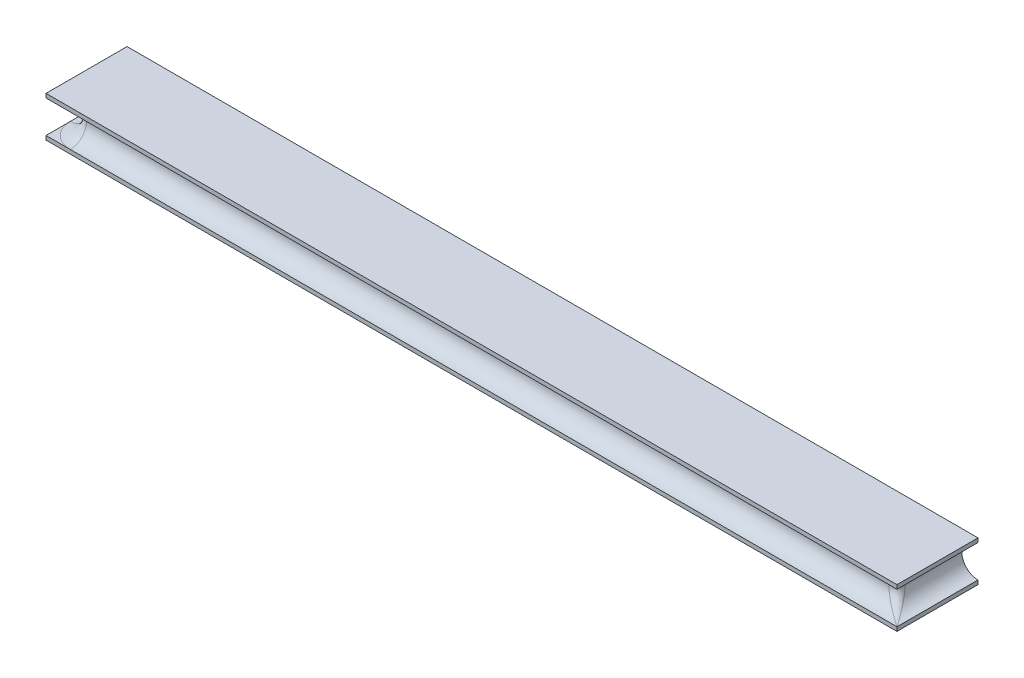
ISO-10303-21;
HEADER;
FILE_DESCRIPTION(('STEP AP214'),'2;1');
FILE_NAME('part.step','',(''),(''),'','','');
FILE_SCHEMA(('AUTOMOTIVE_DESIGN { 1 0 10303 214 1 1 1 1 }'));
ENDSEC;
DATA;
#1=APPLICATION_CONTEXT('core data for automotive mechanical design processes');
#2=APPLICATION_PROTOCOL_DEFINITION('international standard','automotive_design',2000,#1);
#3=PRODUCT_CONTEXT('',#1,'mechanical');
#4=PRODUCT('Part','Part','',(#3));
#5=PRODUCT_RELATED_PRODUCT_CATEGORY('part','',(#4));
#6=PRODUCT_DEFINITION_FORMATION('','',#4);
#7=PRODUCT_DEFINITION_CONTEXT('part definition',#1,'design');
#8=PRODUCT_DEFINITION('design','',#6,#7);
#9=PRODUCT_DEFINITION_SHAPE('','',#8);
#10=(LENGTH_UNIT() NAMED_UNIT(*) SI_UNIT(.MILLI.,.METRE.));
#11=(NAMED_UNIT(*) PLANE_ANGLE_UNIT() SI_UNIT($,.RADIAN.));
#12=(NAMED_UNIT(*) SI_UNIT($,.STERADIAN.) SOLID_ANGLE_UNIT());
#13=UNCERTAINTY_MEASURE_WITH_UNIT(LENGTH_MEASURE(1.E-05),#10,'distance_accuracy_value','');
#14=(GEOMETRIC_REPRESENTATION_CONTEXT(3) GLOBAL_UNCERTAINTY_ASSIGNED_CONTEXT((#13)) GLOBAL_UNIT_ASSIGNED_CONTEXT((#10,
#11,#12)) REPRESENTATION_CONTEXT('',''));
#15=CARTESIAN_POINT('',(0.,0.,0.));
#16=DIRECTION('',(0.,0.,1.));
#17=DIRECTION('',(1.,0.,0.));
#18=AXIS2_PLACEMENT_3D('',#15,#16,#17);
#19=CARTESIAN_POINT('',(52.5,2.5,-5.));
#20=DIRECTION('',(-1.,0.,0.));
#21=DIRECTION('',(0.,0.,1.));
#22=AXIS2_PLACEMENT_3D('',#19,#20,#21);
#23=PLANE('',#22);
#24=DIRECTION('',(0.,-1.,0.));
#25=VECTOR('',#24,1.);
#26=CARTESIAN_POINT('',(52.5,2.5,5.));
#27=LINE('',#26,#25);
#28=CARTESIAN_POINT('',(52.5,2.5,5.));
#29=VERTEX_POINT('',#28);
#30=CARTESIAN_POINT('',(52.5,2.,5.00000000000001));
#31=VERTEX_POINT('',#30);
#32=EDGE_CURVE('E146',#29,#31,#27,.T.);
#33=ORIENTED_EDGE('',*,*,#32,.T.);
#34=DIRECTION('',(0.,0.,-1.));
#35=VECTOR('',#34,1.);
#36=CARTESIAN_POINT('',(52.5,2.,5.00000000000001));
#37=LINE('',#36,#35);
#38=CARTESIAN_POINT('',(52.5,2.,-5.));
#39=VERTEX_POINT('',#38);
#40=EDGE_CURVE('E113',#31,#39,#37,.T.);
#41=ORIENTED_EDGE('',*,*,#40,.T.);
#42=DIRECTION('',(0.,-1.,0.));
#43=VECTOR('',#42,1.);
#44=CARTESIAN_POINT('',(52.5,2.5,-5.));
#45=LINE('',#44,#43);
#46=CARTESIAN_POINT('',(52.5,2.5,-5.));
#47=VERTEX_POINT('',#46);
#48=EDGE_CURVE('E147',#47,#39,#45,.T.);
#49=ORIENTED_EDGE('',*,*,#48,.F.);
#50=DIRECTION('',(0.,0.,-1.));
#51=VECTOR('',#50,1.);
#52=CARTESIAN_POINT('',(52.5,2.5,-5.));
#53=LINE('',#52,#51);
#54=EDGE_CURVE('E163',#29,#47,#53,.T.);
#55=ORIENTED_EDGE('',*,*,#54,.F.);
#56=EDGE_LOOP('',(#33,#41,#49,#55));
#57=FACE_BOUND('',#56,.T.);
#58=ADVANCED_FACE('F31',(#57),#23,.F.);
#59=CARTESIAN_POINT('',(-52.5,2.5,-5.));
#60=DIRECTION('',(1.,0.,0.));
#61=DIRECTION('',(0.,0.,-1.));
#62=AXIS2_PLACEMENT_3D('',#59,#60,#61);
#63=PLANE('',#62);
#64=DIRECTION('',(0.,0.,-1.));
#65=VECTOR('',#64,1.);
#66=CARTESIAN_POINT('',(-52.5,2.,-5.));
#67=LINE('',#66,#65);
#68=CARTESIAN_POINT('',(-52.5,2.,5.));
#69=VERTEX_POINT('',#68);
#70=CARTESIAN_POINT('',(-52.5,2.,2.));
#71=VERTEX_POINT('',#70);
#72=EDGE_CURVE('E178',#69,#71,#67,.T.);
#73=ORIENTED_EDGE('',*,*,#72,.F.);
#74=DIRECTION('',(0.,-1.,0.));
#75=VECTOR('',#74,1.);
#76=CARTESIAN_POINT('',(-52.5,2.5,5.));
#77=LINE('',#76,#75);
#78=CARTESIAN_POINT('',(-52.5,2.5,5.));
#79=VERTEX_POINT('',#78);
#80=EDGE_CURVE('E150',#79,#69,#77,.T.);
#81=ORIENTED_EDGE('',*,*,#80,.F.);
#82=DIRECTION('',(0.,0.,1.));
#83=VECTOR('',#82,1.);
#84=CARTESIAN_POINT('',(-52.5,2.5,-5.));
#85=LINE('',#84,#83);
#86=CARTESIAN_POINT('',(-52.5,2.5,-5.));
#87=VERTEX_POINT('',#86);
#88=EDGE_CURVE('E167',#87,#79,#85,.T.);
#89=ORIENTED_EDGE('',*,*,#88,.F.);
#90=DIRECTION('',(0.,-1.,0.));
#91=VECTOR('',#90,1.);
#92=CARTESIAN_POINT('',(-52.5,2.5,-5.));
#93=LINE('',#92,#91);
#94=CARTESIAN_POINT('',(-52.5,2.00000000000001,-5.));
#95=VERTEX_POINT('',#94);
#96=EDGE_CURVE('E158',#87,#95,#93,.T.);
#97=ORIENTED_EDGE('',*,*,#96,.T.);
#98=DIRECTION('',(0.,0.,-1.));
#99=VECTOR('',#98,1.);
#100=CARTESIAN_POINT('',(-52.5,2.,2.));
#101=LINE('',#100,#99);
#102=EDGE_CURVE('E46',#71,#95,#101,.T.);
#103=ORIENTED_EDGE('',*,*,#102,.F.);
#104=EDGE_LOOP('',(#73,#81,#89,#97,#103));
#105=FACE_BOUND('',#104,.T.);
#106=ADVANCED_FACE('F33',(#105),#63,.F.);
#107=DIRECTION('',(0.,0.,-1.));
#108=VECTOR('',#107,1.);
#109=CARTESIAN_POINT('',(-52.5,-2.,2.));
#110=LINE('',#109,#108);
#111=CARTESIAN_POINT('',(-52.5,-2.,2.));
#112=VERTEX_POINT('',#111);
#113=CARTESIAN_POINT('',(-52.5,-2.,-5.));
#114=VERTEX_POINT('',#113);
#115=EDGE_CURVE('E193',#112,#114,#110,.T.);
#116=ORIENTED_EDGE('',*,*,#115,.T.);
#117=CARTESIAN_POINT('',(-52.5,-2.5,-5.));
#118=VERTEX_POINT('',#117);
#119=EDGE_CURVE('E161',#114,#118,#93,.T.);
#120=ORIENTED_EDGE('',*,*,#119,.T.);
#121=DIRECTION('',(0.,0.,1.));
#122=VECTOR('',#121,1.);
#123=CARTESIAN_POINT('',(-52.5,-2.5,-5.));
#124=LINE('',#123,#122);
#125=CARTESIAN_POINT('',(-52.5,-2.5,5.));
#126=VERTEX_POINT('',#125);
#127=EDGE_CURVE('E175',#118,#126,#124,.T.);
#128=ORIENTED_EDGE('',*,*,#127,.T.);
#129=CARTESIAN_POINT('',(-52.5,-2.,5.));
#130=VERTEX_POINT('',#129);
#131=EDGE_CURVE('E152',#130,#126,#77,.T.);
#132=ORIENTED_EDGE('',*,*,#131,.F.);
#133=DIRECTION('',(0.,0.,1.));
#134=VECTOR('',#133,1.);
#135=CARTESIAN_POINT('',(-52.5,-2.,-5.));
#136=LINE('',#135,#134);
#137=EDGE_CURVE('E182',#112,#130,#136,.T.);
#138=ORIENTED_EDGE('',*,*,#137,.F.);
#139=EDGE_LOOP('',(#116,#120,#128,#132,#138));
#140=FACE_BOUND('',#139,.T.);
#141=ADVANCED_FACE('F233',(#140),#63,.F.);
#142=CARTESIAN_POINT('',(-52.5,2.5,5.));
#143=DIRECTION('',(0.,0.,-1.));
#144=DIRECTION('',(-1.,0.,0.));
#145=AXIS2_PLACEMENT_3D('',#142,#143,#144);
#146=PLANE('',#145);
#147=DIRECTION('',(1.,0.,0.));
#148=VECTOR('',#147,1.);
#149=CARTESIAN_POINT('',(-49.5,2.,5.00000000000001));
#150=LINE('',#149,#148);
#151=CARTESIAN_POINT('',(-49.5,2.,5.00000000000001));
#152=VERTEX_POINT('',#151);
#153=EDGE_CURVE('E139',#152,#31,#150,.T.);
#154=ORIENTED_EDGE('',*,*,#153,.T.);
#155=ORIENTED_EDGE('',*,*,#32,.F.);
#156=DIRECTION('',(1.,0.,0.));
#157=VECTOR('',#156,1.);
#158=CARTESIAN_POINT('',(-52.5,2.5,5.));
#159=LINE('',#158,#157);
#160=EDGE_CURVE('E165',#79,#29,#159,.T.);
#161=ORIENTED_EDGE('',*,*,#160,.F.);
#162=ORIENTED_EDGE('',*,*,#80,.T.);
#163=DIRECTION('',(-1.,0.,0.));
#164=VECTOR('',#163,1.);
#165=CARTESIAN_POINT('',(-52.5,2.,5.));
#166=LINE('',#165,#164);
#167=EDGE_CURVE('E180',#152,#69,#166,.T.);
#168=ORIENTED_EDGE('',*,*,#167,.F.);
#169=EDGE_LOOP('',(#154,#155,#161,#162,#168));
#170=FACE_BOUND('',#169,.T.);
#171=ADVANCED_FACE('F231',(#170),#146,.F.);
#172=DIRECTION('',(1.,0.,0.));
#173=VECTOR('',#172,1.);
#174=CARTESIAN_POINT('',(-52.5,-2.,5.));
#175=LINE('',#174,#173);
#176=CARTESIAN_POINT('',(-49.5,-2.,5.00000000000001));
#177=VERTEX_POINT('',#176);
#178=EDGE_CURVE('E184',#130,#177,#175,.T.);
#179=ORIENTED_EDGE('',*,*,#178,.F.);
#180=ORIENTED_EDGE('',*,*,#131,.T.);
#181=DIRECTION('',(1.,0.,0.));
#182=VECTOR('',#181,1.);
#183=CARTESIAN_POINT('',(-52.5,-2.5,5.));
#184=LINE('',#183,#182);
#185=CARTESIAN_POINT('',(52.5,-2.5,5.));
#186=VERTEX_POINT('',#185);
#187=EDGE_CURVE('E144',#126,#186,#184,.T.);
#188=ORIENTED_EDGE('',*,*,#187,.T.);
#189=CARTESIAN_POINT('',(52.5,-2.,5.00000000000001));
#190=VERTEX_POINT('',#189);
#191=EDGE_CURVE('E124',#190,#186,#27,.T.);
#192=ORIENTED_EDGE('',*,*,#191,.F.);
#193=DIRECTION('',(1.,0.,0.));
#194=VECTOR('',#193,1.);
#195=CARTESIAN_POINT('',(-49.5,-2.,5.00000000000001));
#196=LINE('',#195,#194);
#197=EDGE_CURVE('E132',#177,#190,#196,.T.);
#198=ORIENTED_EDGE('',*,*,#197,.F.);
#199=EDGE_LOOP('',(#179,#180,#188,#192,#198));
#200=FACE_BOUND('',#199,.T.);
#201=ADVANCED_FACE('F142',(#200),#146,.F.);
#202=CARTESIAN_POINT('',(-52.5,2.5,-5.));
#203=DIRECTION('',(0.,0.,1.));
#204=DIRECTION('',(1.,0.,0.));
#205=AXIS2_PLACEMENT_3D('',#202,#203,#204);
#206=PLANE('',#205);
#207=ORIENTED_EDGE('',*,*,#48,.T.);
#208=CARTESIAN_POINT('',(52.5,0.,-5.));
#209=DIRECTION('',(0.,0.,-1.));
#210=DIRECTION('',(-1.,0.,0.));
#211=AXIS2_PLACEMENT_3D('',#208,#209,#210);
#212=CIRCLE('',#211,2.);
#213=CARTESIAN_POINT('',(52.5,-2.,-5.));
#214=VERTEX_POINT('',#213);
#215=EDGE_CURVE('E127',#214,#39,#212,.T.);
#216=ORIENTED_EDGE('',*,*,#215,.F.);
#217=CARTESIAN_POINT('',(52.5,-2.5,-5.));
#218=VERTEX_POINT('',#217);
#219=EDGE_CURVE('E126',#214,#218,#45,.T.);
#220=ORIENTED_EDGE('',*,*,#219,.T.);
#221=DIRECTION('',(-1.,0.,0.));
#222=VECTOR('',#221,1.);
#223=CARTESIAN_POINT('',(-52.5,-2.5,-5.));
#224=LINE('',#223,#222);
#225=EDGE_CURVE('E169',#218,#118,#224,.T.);
#226=ORIENTED_EDGE('',*,*,#225,.T.);
#227=ORIENTED_EDGE('',*,*,#119,.F.);
#228=CARTESIAN_POINT('',(-52.5,0.,-5.));
#229=DIRECTION('',(0.,0.,1.));
#230=DIRECTION('',(1.,0.,0.));
#231=AXIS2_PLACEMENT_3D('',#228,#229,#230);
#232=CIRCLE('',#231,2.);
#233=EDGE_CURVE('E198',#114,#95,#232,.T.);
#234=ORIENTED_EDGE('',*,*,#233,.T.);
#235=ORIENTED_EDGE('',*,*,#96,.F.);
#236=DIRECTION('',(-1.,0.,0.));
#237=VECTOR('',#236,1.);
#238=CARTESIAN_POINT('',(-52.5,2.5,-5.));
#239=LINE('',#238,#237);
#240=EDGE_CURVE('E54',#47,#87,#239,.T.);
#241=ORIENTED_EDGE('',*,*,#240,.F.);
#242=EDGE_LOOP('',(#207,#216,#220,#226,#227,#234,#235,#241));
#243=FACE_BOUND('',#242,.T.);
#244=ADVANCED_FACE('F226',(#243),#206,.F.);
#245=ORIENTED_EDGE('',*,*,#219,.F.);
#246=DIRECTION('',(0.,0.,-1.));
#247=VECTOR('',#246,1.);
#248=CARTESIAN_POINT('',(52.5,-2.,5.00000000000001));
#249=LINE('',#248,#247);
#250=EDGE_CURVE('E110',#214,#190,#249,.F.);
#251=ORIENTED_EDGE('',*,*,#250,.T.);
#252=ORIENTED_EDGE('',*,*,#191,.T.);
#253=DIRECTION('',(0.,0.,-1.));
#254=VECTOR('',#253,1.);
#255=CARTESIAN_POINT('',(52.5,-2.5,-5.));
#256=LINE('',#255,#254);
#257=EDGE_CURVE('E172',#186,#218,#256,.T.);
#258=ORIENTED_EDGE('',*,*,#257,.T.);
#259=EDGE_LOOP('',(#245,#251,#252,#258));
#260=FACE_BOUND('',#259,.T.);
#261=ADVANCED_FACE('F121',(#260),#23,.F.);
#262=CARTESIAN_POINT('',(-52.5,2.5,5.));
#263=DIRECTION('',(0.,1.,0.));
#264=DIRECTION('',(0.,0.,1.));
#265=AXIS2_PLACEMENT_3D('',#262,#263,#264);
#266=PLANE('',#265);
#267=ORIENTED_EDGE('',*,*,#88,.T.);
#268=ORIENTED_EDGE('',*,*,#160,.T.);
#269=ORIENTED_EDGE('',*,*,#54,.T.);
#270=ORIENTED_EDGE('',*,*,#240,.T.);
#271=EDGE_LOOP('',(#267,#268,#269,#270));
#272=FACE_BOUND('',#271,.T.);
#273=ADVANCED_FACE('F222',(#272),#266,.T.);
#274=CARTESIAN_POINT('',(-52.5,-2.5,5.));
#275=DIRECTION('',(0.,1.,0.));
#276=DIRECTION('',(0.,0.,1.));
#277=AXIS2_PLACEMENT_3D('',#274,#275,#276);
#278=PLANE('',#277);
#279=ORIENTED_EDGE('',*,*,#127,.F.);
#280=ORIENTED_EDGE('',*,*,#225,.F.);
#281=ORIENTED_EDGE('',*,*,#257,.F.);
#282=ORIENTED_EDGE('',*,*,#187,.F.);
#283=EDGE_LOOP('',(#279,#280,#281,#282));
#284=FACE_BOUND('',#283,.T.);
#285=ADVANCED_FACE('F218',(#284),#278,.F.);
#286=CARTESIAN_POINT('',(-52.5,2.,2.));
#287=DIRECTION('',(0.,-1.,0.));
#288=DIRECTION('',(1.,0.,0.));
#289=AXIS2_PLACEMENT_3D('',#286,#287,#288);
#290=PLANE('',#289);
#291=ORIENTED_EDGE('',*,*,#72,.T.);
#292=CARTESIAN_POINT('',(-49.5,2.,2.));
#293=DIRECTION('',(0.,1.,0.));
#294=DIRECTION('',(0.,0.,1.));
#295=AXIS2_PLACEMENT_3D('',#292,#293,#294);
#296=CIRCLE('',#295,3.00000000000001);
#297=EDGE_CURVE('E140',#71,#152,#296,.T.);
#298=ORIENTED_EDGE('',*,*,#297,.T.);
#299=ORIENTED_EDGE('',*,*,#167,.T.);
#300=EDGE_LOOP('',(#291,#298,#299));
#301=FACE_BOUND('',#300,.T.);
#302=ADVANCED_FACE('F221',(#301),#290,.T.);
#303=CARTESIAN_POINT('',(-62.5,-2.,2.));
#304=DIRECTION('',(0.,1.,0.));
#305=DIRECTION('',(-1.,0.,0.));
#306=AXIS2_PLACEMENT_3D('',#303,#304,#305);
#307=PLANE('',#306);
#308=ORIENTED_EDGE('',*,*,#137,.T.);
#309=ORIENTED_EDGE('',*,*,#178,.T.);
#310=CARTESIAN_POINT('',(-49.5,-2.,2.));
#311=DIRECTION('',(0.,1.,0.));
#312=DIRECTION('',(0.,0.,1.));
#313=AXIS2_PLACEMENT_3D('',#310,#311,#312);
#314=CIRCLE('',#313,3.00000000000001);
#315=EDGE_CURVE('E189',#112,#177,#314,.T.);
#316=ORIENTED_EDGE('',*,*,#315,.F.);
#317=EDGE_LOOP('',(#308,#309,#316));
#318=FACE_BOUND('',#317,.T.);
#319=ADVANCED_FACE('F216',(#318),#307,.T.);
#320=CARTESIAN_POINT('',(-49.5,0.,5.00000000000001));
#321=DIRECTION('',(1.,0.,0.));
#322=DIRECTION('',(0.,0.,-1.));
#323=AXIS2_PLACEMENT_3D('',#320,#321,#322);
#324=CYLINDRICAL_SURFACE('',#323,2.);
#325=ORIENTED_EDGE('',*,*,#197,.T.);
#326=CARTESIAN_POINT('',(52.5,0.,5.00000000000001));
#327=DIRECTION('',(-0.554700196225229,0.,0.832050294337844));
#328=DIRECTION('',(0.832050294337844,0.,0.554700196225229));
#329=AXIS2_PLACEMENT_3D('',#326,#327,#328);
#330=ELLIPSE('',#329,3.60555127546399,2.);
#331=EDGE_CURVE('E39',#190,#31,#330,.F.);
#332=ORIENTED_EDGE('',*,*,#331,.T.);
#333=ORIENTED_EDGE('',*,*,#153,.F.);
#334=CARTESIAN_POINT('',(-49.5,0.,5.00000000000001));
#335=DIRECTION('',(1.,0.,0.));
#336=DIRECTION('',(0.,0.,-1.));
#337=AXIS2_PLACEMENT_3D('',#334,#335,#336);
#338=CIRCLE('',#337,2.);
#339=EDGE_CURVE('E135',#177,#152,#338,.T.);
#340=ORIENTED_EDGE('',*,*,#339,.F.);
#341=EDGE_LOOP('',(#325,#332,#333,#340));
#342=FACE_BOUND('',#341,.T.);
#343=ADVANCED_FACE('F133',(#342),#324,.F.);
#344=CARTESIAN_POINT('',(-49.5,0.,2.));
#345=DIRECTION('',(0.,1.,0.));
#346=DIRECTION('',(0.,0.,1.));
#347=AXIS2_PLACEMENT_3D('',#344,#345,#346);
#348=TOROIDAL_SURFACE('',#347,3.00000000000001,2.);
#349=CARTESIAN_POINT('',(-52.5,0.,2.));
#350=DIRECTION('',(0.,0.,1.));
#351=DIRECTION('',(1.,0.,0.));
#352=AXIS2_PLACEMENT_3D('',#349,#350,#351);
#353=CIRCLE('',#352,2.);
#354=EDGE_CURVE('E196',#112,#71,#353,.T.);
#355=ORIENTED_EDGE('',*,*,#354,.F.);
#356=ORIENTED_EDGE('',*,*,#315,.T.);
#357=ORIENTED_EDGE('',*,*,#339,.T.);
#358=ORIENTED_EDGE('',*,*,#297,.F.);
#359=EDGE_LOOP('',(#355,#356,#357,#358));
#360=FACE_BOUND('',#359,.T.);
#361=ADVANCED_FACE('F215',(#360),#348,.F.);
#362=CARTESIAN_POINT('',(-52.5,0.,2.));
#363=DIRECTION('',(0.,0.,-1.));
#364=DIRECTION('',(-1.,0.,0.));
#365=AXIS2_PLACEMENT_3D('',#362,#363,#364);
#366=CYLINDRICAL_SURFACE('',#365,2.);
#367=ORIENTED_EDGE('',*,*,#233,.F.);
#368=ORIENTED_EDGE('',*,*,#115,.F.);
#369=ORIENTED_EDGE('',*,*,#354,.T.);
#370=ORIENTED_EDGE('',*,*,#102,.T.);
#371=EDGE_LOOP('',(#367,#368,#369,#370));
#372=FACE_BOUND('',#371,.T.);
#373=ADVANCED_FACE('F259',(#372),#366,.F.);
#374=CARTESIAN_POINT('',(52.5,0.,5.00000000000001));
#375=DIRECTION('',(0.,0.,-1.));
#376=DIRECTION('',(-1.,0.,0.));
#377=AXIS2_PLACEMENT_3D('',#374,#375,#376);
#378=CYLINDRICAL_SURFACE('',#377,2.);
#379=ORIENTED_EDGE('',*,*,#40,.F.);
#380=CARTESIAN_POINT('',(52.5,0.,5.00000000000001));
#381=DIRECTION('',(-0.832050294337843,0.,0.554700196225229));
#382=DIRECTION('',(0.554700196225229,0.,0.832050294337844));
#383=AXIS2_PLACEMENT_3D('',#380,#381,#382);
#384=ELLIPSE('',#383,3.60555127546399,2.);
#385=EDGE_CURVE('E11',#31,#190,#384,.T.);
#386=ORIENTED_EDGE('',*,*,#385,.T.);
#387=ORIENTED_EDGE('',*,*,#250,.F.);
#388=ORIENTED_EDGE('',*,*,#215,.T.);
#389=EDGE_LOOP('',(#379,#386,#387,#388));
#390=FACE_BOUND('',#389,.T.);
#391=ADVANCED_FACE('F109',(#390),#378,.F.);
#392=CARTESIAN_POINT('',(52.5,-2.,5.00000000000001));
#393=CARTESIAN_POINT('',(52.5,-2.,5.00000000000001));
#394=CARTESIAN_POINT('',(52.5,-2.,5.00000000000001));
#395=CARTESIAN_POINT('',(52.4128705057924,-1.99996494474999,4.86930575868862));
#396=CARTESIAN_POINT('',(52.391066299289,-2.00016272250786,4.89106629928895));
#397=CARTESIAN_POINT('',(52.3693057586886,-1.99996494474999,4.91287050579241));
#398=CARTESIAN_POINT('',(52.3257187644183,-1.99430351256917,4.73857814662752));
#399=CARTESIAN_POINT('',(52.281833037,-1.99145184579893,4.781833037));
#400=CARTESIAN_POINT('',(52.2385781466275,-1.99430351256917,4.82571876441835));
#401=CARTESIAN_POINT('',(52.1529140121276,-1.9715729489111,4.47937101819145));
#402=CARTESIAN_POINT('',(52.066963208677,-1.95733968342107,4.56696320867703));
#403=CARTESIAN_POINT('',(51.9793710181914,-1.9715729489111,4.65291401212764));
#404=CARTESIAN_POINT('',(52.0672545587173,-1.95460119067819,4.3508818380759));
#405=CARTESIAN_POINT('',(51.9607087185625,-1.93188935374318,4.46070871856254));
#406=CARTESIAN_POINT('',(51.8508818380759,-1.95460119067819,4.56725455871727));
#407=CARTESIAN_POINT('',(51.8988931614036,-1.90948369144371,4.09833974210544));
#408=CARTESIAN_POINT('',(51.7547465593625,-1.86505551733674,4.25474655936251));
#409=CARTESIAN_POINT('',(51.5983397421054,-1.90948369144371,4.39889316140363));
#410=CARTESIAN_POINT('',(51.8161657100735,-1.88153014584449,3.97424856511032));
#411=CARTESIAN_POINT('',(51.6544286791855,-1.82357549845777,4.15442867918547));
#412=CARTESIAN_POINT('',(51.4742485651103,-1.88153014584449,4.31616571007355));
#413=CARTESIAN_POINT('',(51.6551090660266,-1.81481991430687,3.73266359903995));
#414=CARTESIAN_POINT('',(51.4631847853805,-1.72635813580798,3.9631847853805));
#415=CARTESIAN_POINT('',(51.2326635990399,-1.81481991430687,4.15510906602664));
#416=CARTESIAN_POINT('',(51.5767217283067,-1.77634632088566,3.61508259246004));
#417=CARTESIAN_POINT('',(51.3716685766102,-1.67047797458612,3.87166857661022));
#418=CARTESIAN_POINT('',(51.11508259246,-1.77634632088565,4.0767217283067));
#419=CARTESIAN_POINT('',(51.4257203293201,-1.68916522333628,3.38858049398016));
#420=CARTESIAN_POINT('',(51.2006814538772,-1.54685402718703,3.70068145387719));
#421=CARTESIAN_POINT('',(50.8885804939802,-1.68916522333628,3.92572032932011));
#422=CARTESIAN_POINT('',(51.3530019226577,-1.64082244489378,3.27950288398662));
#423=CARTESIAN_POINT('',(51.1206560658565,-1.4789289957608,3.62065606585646));
#424=CARTESIAN_POINT('',(50.7795028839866,-1.64082244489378,3.85300192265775));
#425=CARTESIAN_POINT('',(51.2146318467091,-1.53464696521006,3.0719477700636));
#426=CARTESIAN_POINT('',(50.9749317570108,-1.33453674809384,3.47493175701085));
#427=CARTESIAN_POINT('',(50.5719477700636,-1.53464696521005,3.71463184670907));
#428=CARTESIAN_POINT('',(51.1488166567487,-1.47724460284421,2.9732249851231));
#429=CARTESIAN_POINT('',(50.908736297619,-1.25786719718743,3.408736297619));
#430=CARTESIAN_POINT('',(50.4732249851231,-1.47724460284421,3.64881665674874));
#431=CARTESIAN_POINT('',(51.0254414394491,-1.35386777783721,2.78816215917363));
#432=CARTESIAN_POINT('',(50.7922741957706,-1.10029481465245,3.29227419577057));
#433=CARTESIAN_POINT('',(50.2881621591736,-1.35386777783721,3.52544143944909));
#434=CARTESIAN_POINT('',(50.967649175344,-1.28836268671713,2.70147376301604));
#435=CARTESIAN_POINT('',(50.7415943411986,-1.01920078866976,3.24159434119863));
#436=CARTESIAN_POINT('',(50.201473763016,-1.28836268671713,3.46764917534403));
#437=CARTESIAN_POINT('',(50.8613806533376,-1.14986714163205,2.54207098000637));
#438=CARTESIAN_POINT('',(50.6566142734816,-0.857956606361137,3.15661427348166));
#439=CARTESIAN_POINT('',(50.0420709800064,-1.14986714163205,3.36138065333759));
#440=CARTESIAN_POINT('',(50.8126024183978,-1.07734548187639,2.46890362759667));
#441=CARTESIAN_POINT('',(50.622006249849,-0.777674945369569,3.12200624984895));
#442=CARTESIAN_POINT('',(49.9689036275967,-1.07734548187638,3.31260241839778));
#443=CARTESIAN_POINT('',(50.7252680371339,-0.926070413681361,2.3379020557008));
#444=CARTESIAN_POINT('',(50.5678858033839,-0.62347564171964,3.06788580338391));
#445=CARTESIAN_POINT('',(49.8379020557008,-0.926070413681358,3.22526803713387));
#446=CARTESIAN_POINT('',(50.686355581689,-0.84773367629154,2.27953337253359));
#447=CARTESIAN_POINT('',(50.5481794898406,-0.54954427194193,3.04817948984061));
#448=CARTESIAN_POINT('',(49.7795333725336,-0.847733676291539,3.18635558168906));
#449=CARTESIAN_POINT('',(50.6194694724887,-0.686243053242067,2.17920420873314));
#450=CARTESIAN_POINT('',(50.5204537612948,-0.412265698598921,3.02045376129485));
#451=CARTESIAN_POINT('',(49.6792042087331,-0.686243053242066,3.11946947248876));
#452=CARTESIAN_POINT('',(50.5911254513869,-0.603400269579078,2.13668817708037));
#453=CARTESIAN_POINT('',(50.5123405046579,-0.349070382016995,3.0123405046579));
#454=CARTESIAN_POINT('',(49.6366881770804,-0.603400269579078,3.09112545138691));
#455=CARTESIAN_POINT('',(50.5458611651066,-0.434451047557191,2.06879174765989));
#456=CARTESIAN_POINT('',(50.5027193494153,-0.234139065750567,3.00271934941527));
#457=CARTESIAN_POINT('',(49.5687917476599,-0.43445104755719,3.0458611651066));
#458=CARTESIAN_POINT('',(50.5286234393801,-0.348517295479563,2.0429351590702));
#459=CARTESIAN_POINT('',(50.5011830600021,-0.182730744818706,3.00118306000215));
#460=CARTESIAN_POINT('',(49.5429351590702,-0.348517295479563,3.02862343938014));
#461=CARTESIAN_POINT('',(50.5057860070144,-0.175022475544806,2.00867901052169));
#462=CARTESIAN_POINT('',(50.4998244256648,-0.087326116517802,2.99982442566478));
#463=CARTESIAN_POINT('',(49.5086790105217,-0.175022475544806,3.00578600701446));
#464=CARTESIAN_POINT('',(50.5,-0.0875112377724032,2.00000000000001));
#465=CARTESIAN_POINT('',(50.5,-0.043790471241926,3.00000000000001));
#466=CARTESIAN_POINT('',(49.5,-0.0875112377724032,3.00000000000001));
#467=CARTESIAN_POINT('',(50.5,0.0875112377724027,2.00000000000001));
#468=CARTESIAN_POINT('',(50.5,0.0437904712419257,3.00000000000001));
#469=CARTESIAN_POINT('',(49.5,0.0875112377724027,3.00000000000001));
#470=CARTESIAN_POINT('',(50.5057860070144,0.175022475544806,2.00867901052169));
#471=CARTESIAN_POINT('',(50.4998244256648,0.0873261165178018,2.99982442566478));
#472=CARTESIAN_POINT('',(49.5086790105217,0.175022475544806,3.00578600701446));
#473=CARTESIAN_POINT('',(50.5286234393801,0.348517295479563,2.0429351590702));
#474=CARTESIAN_POINT('',(50.5011830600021,0.182730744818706,3.00118306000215));
#475=CARTESIAN_POINT('',(49.5429351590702,0.348517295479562,3.02862343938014));
#476=CARTESIAN_POINT('',(50.5458611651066,0.43445104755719,2.06879174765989));
#477=CARTESIAN_POINT('',(50.5027193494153,0.234139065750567,3.00271934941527));
#478=CARTESIAN_POINT('',(49.5687917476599,0.434451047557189,3.0458611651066));
#479=CARTESIAN_POINT('',(50.5911254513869,0.603400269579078,2.13668817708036));
#480=CARTESIAN_POINT('',(50.5123405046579,0.349070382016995,3.0123405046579));
#481=CARTESIAN_POINT('',(49.6366881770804,0.603400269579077,3.09112545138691));
#482=CARTESIAN_POINT('',(50.6194694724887,0.686243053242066,2.17920420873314));
#483=CARTESIAN_POINT('',(50.5204537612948,0.41226569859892,3.02045376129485));
#484=CARTESIAN_POINT('',(49.6792042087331,0.686243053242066,3.11946947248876));
#485=CARTESIAN_POINT('',(50.686355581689,0.847733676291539,2.27953337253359));
#486=CARTESIAN_POINT('',(50.5481794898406,0.54954427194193,3.04817948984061));
#487=CARTESIAN_POINT('',(49.7795333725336,0.847733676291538,3.18635558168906));
#488=CARTESIAN_POINT('',(50.7252680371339,0.926070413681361,2.3379020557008));
#489=CARTESIAN_POINT('',(50.5678858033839,0.62347564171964,3.06788580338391));
#490=CARTESIAN_POINT('',(49.8379020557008,0.926070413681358,3.22526803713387));
#491=CARTESIAN_POINT('',(50.8126024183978,1.07734548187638,2.46890362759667));
#492=CARTESIAN_POINT('',(50.622006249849,0.777674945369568,3.12200624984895));
#493=CARTESIAN_POINT('',(49.9689036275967,1.07734548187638,3.31260241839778));
#494=CARTESIAN_POINT('',(50.8613806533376,1.14986714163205,2.54207098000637));
#495=CARTESIAN_POINT('',(50.6566142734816,0.857956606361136,3.15661427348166));
#496=CARTESIAN_POINT('',(50.0420709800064,1.14986714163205,3.36138065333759));
#497=CARTESIAN_POINT('',(50.967649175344,1.28836268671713,2.70147376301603));
#498=CARTESIAN_POINT('',(50.7415943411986,1.01920078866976,3.24159434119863));
#499=CARTESIAN_POINT('',(50.201473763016,1.28836268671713,3.46764917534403));
#500=CARTESIAN_POINT('',(51.0254414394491,1.35386777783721,2.78816215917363));
#501=CARTESIAN_POINT('',(50.7922741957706,1.10029481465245,3.29227419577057));
#502=CARTESIAN_POINT('',(50.2881621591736,1.35386777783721,3.52544143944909));
#503=CARTESIAN_POINT('',(51.1488166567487,1.47724460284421,2.9732249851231));
#504=CARTESIAN_POINT('',(50.908736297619,1.25786719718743,3.408736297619));
#505=CARTESIAN_POINT('',(50.4732249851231,1.47724460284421,3.64881665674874));
#506=CARTESIAN_POINT('',(51.2146318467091,1.53464696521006,3.0719477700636));
#507=CARTESIAN_POINT('',(50.9749317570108,1.33453674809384,3.47493175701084));
#508=CARTESIAN_POINT('',(50.5719477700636,1.53464696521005,3.71463184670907));
#509=CARTESIAN_POINT('',(51.3530019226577,1.64082244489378,3.27950288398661));
#510=CARTESIAN_POINT('',(51.1206560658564,1.4789289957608,3.62065606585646));
#511=CARTESIAN_POINT('',(50.7795028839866,1.64082244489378,3.85300192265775));
#512=CARTESIAN_POINT('',(51.4257203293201,1.68916522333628,3.38858049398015));
#513=CARTESIAN_POINT('',(51.2006814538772,1.54685402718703,3.70068145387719));
#514=CARTESIAN_POINT('',(50.8885804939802,1.68916522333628,3.92572032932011));
#515=CARTESIAN_POINT('',(51.5767217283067,1.77634632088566,3.61508259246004));
#516=CARTESIAN_POINT('',(51.3716685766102,1.67047797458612,3.87166857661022));
#517=CARTESIAN_POINT('',(51.11508259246,1.77634632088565,4.0767217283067));
#518=CARTESIAN_POINT('',(51.6551090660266,1.81481991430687,3.73266359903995));
#519=CARTESIAN_POINT('',(51.4631847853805,1.72635813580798,3.9631847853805));
#520=CARTESIAN_POINT('',(51.2326635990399,1.81481991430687,4.15510906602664));
#521=CARTESIAN_POINT('',(51.8161657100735,1.88153014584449,3.97424856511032));
#522=CARTESIAN_POINT('',(51.6544286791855,1.82357549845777,4.15442867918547));
#523=CARTESIAN_POINT('',(51.4742485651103,1.88153014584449,4.31616571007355));
#524=CARTESIAN_POINT('',(51.8988931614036,1.90948369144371,4.09833974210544));
#525=CARTESIAN_POINT('',(51.7547465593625,1.86505551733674,4.25474655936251));
#526=CARTESIAN_POINT('',(51.5983397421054,1.90948369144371,4.39889316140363));
#527=CARTESIAN_POINT('',(52.0672545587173,1.95460119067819,4.3508818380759));
#528=CARTESIAN_POINT('',(51.9607087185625,1.93188935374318,4.46070871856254));
#529=CARTESIAN_POINT('',(51.8508818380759,1.95460119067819,4.56725455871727));
#530=CARTESIAN_POINT('',(52.1529140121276,1.9715729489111,4.47937101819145));
#531=CARTESIAN_POINT('',(52.066963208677,1.95733968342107,4.56696320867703));
#532=CARTESIAN_POINT('',(51.9793710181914,1.9715729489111,4.65291401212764));
#533=CARTESIAN_POINT('',(52.3257187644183,1.99430351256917,4.73857814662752));
#534=CARTESIAN_POINT('',(52.281833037,1.99145184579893,4.781833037));
#535=CARTESIAN_POINT('',(52.2385781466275,1.99430351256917,4.82571876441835));
#536=CARTESIAN_POINT('',(52.4128705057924,1.99996494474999,4.86930575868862));
#537=CARTESIAN_POINT('',(52.391066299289,2.00016272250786,4.89106629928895));
#538=CARTESIAN_POINT('',(52.3693057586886,1.99996494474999,4.91287050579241));
#539=CARTESIAN_POINT('',(52.5,2.,5.00000000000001));
#540=CARTESIAN_POINT('',(52.5,2.,5.00000000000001));
#541=CARTESIAN_POINT('',(52.5,2.,5.00000000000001));
#542=(BOUNDED_SURFACE() B_SPLINE_SURFACE(3,2,((#392,#393,#394),(#395,#396,#397),(#398,#399,
#400),(#401,#402,#403),(#404,#405,#406),(#407,#408,#409),(#410,#411,#412),(#413,#414,#415),
(#416,#417,#418),(#419,#420,#421),(#422,#423,#424),(#425,#426,#427),(#428,#429,#430),(#431,#432,
#433),(#434,#435,#436),(#437,#438,#439),(#440,#441,#442),(#443,#444,#445),(#446,#447,#448),
(#449,#450,#451),(#452,#453,#454),(#455,#456,#457),(#458,#459,#460),(#461,#462,#463),(#464,#465,
#466),(#467,#468,#469),(#470,#471,#472),(#473,#474,#475),(#476,#477,#478),(#479,#480,#481),
(#482,#483,#484),(#485,#486,#487),(#488,#489,#490),(#491,#492,#493),(#494,#495,#496),(#497,#498,
#499),(#500,#501,#502),(#503,#504,#505),(#506,#507,#508),(#509,#510,#511),(#512,#513,#514),
(#515,#516,#517),(#518,#519,#520),(#521,#522,#523),(#524,#525,#526),(#527,#528,#529),(#530,#531,
#532),(#533,#534,#535),(#536,#537,#538),(#539,#540,#541)),.UNSPECIFIED.,.F.,.F.,
.F.) B_SPLINE_SURFACE_WITH_KNOTS((4,2,2,2,2,2,2,2,2,2,2,2,2,2,2,2,2,2,2,2,2,2,2,2,4),(3,3),(0.,
0.554370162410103,1.10402823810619,1.64446692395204,2.17159223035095,2.68193910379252,
3.17289609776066,3.64293728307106,4.09185103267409,4.52093889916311,4.93313243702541,
5.33294925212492,5.72620643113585,6.11946361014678,6.51928042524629,6.93147396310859,
7.36056182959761,7.80947557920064,8.27951676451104,8.77047375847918,9.28082063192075,
9.80794593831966,10.3483846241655,10.8980426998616,11.4524128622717),(0.,1.),
.UNSPECIFIED.) GEOMETRIC_REPRESENTATION_ITEM() RATIONAL_B_SPLINE_SURFACE(((1.,1.,1.),(1.,
1.00000566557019,1.),(1.,0.998576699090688,1.),(1.,0.992910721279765,1.),(1.,0.988697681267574,
1.),(1.,0.97761712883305,1.),(1.,0.970795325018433,1.),(1.,0.954789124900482,1.),(1.,
0.945667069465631,1.),(1.,0.925487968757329,1.),(1.,0.914501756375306,1.),(1.,0.891169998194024,
1.),(1.,0.878891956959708,1.),(1.,0.853706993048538,1.),(1.,0.84084914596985,1.),(1.,
0.815387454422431,1.),(1.,0.802798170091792,1.),(1.,0.778880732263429,1.),(1.,0.767521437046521,
1.),(1.,0.747118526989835,1.),(1.,0.738001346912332,1.),(1.,0.723039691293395,1.),(1.,
0.717105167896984,1.),(1.,0.709170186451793,1.),(1.,0.707106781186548,1.),(1.,0.707106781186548,
1.),(1.,0.709170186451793,1.),(1.,0.717105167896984,1.),(1.,0.723039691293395,1.),(1.,
0.738001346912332,1.),(1.,0.747118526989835,1.),(1.,0.767521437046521,1.),(1.,0.778880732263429,
1.),(1.,0.802798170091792,1.),(1.,0.815387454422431,1.),(1.,0.84084914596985,1.),(1.,
0.853706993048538,1.),(1.,0.878891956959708,1.),(1.,0.891169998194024,1.),(1.,0.914501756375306,
1.),(1.,0.925487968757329,1.),(1.,0.94566706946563,1.),(1.,0.954789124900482,1.),(1.,
0.970795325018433,1.),(1.,0.97761712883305,1.),(1.,0.988697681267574,1.),(1.,0.992910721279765,
1.),(1.,0.998576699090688,1.),(1.,1.00000566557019,1.),(1.,1.,1.))) REPRESENTATION_ITEM('') SURFACE());
#543=ORIENTED_EDGE('',*,*,#331,.F.);
#544=ORIENTED_EDGE('',*,*,#385,.F.);
#545=EDGE_LOOP('',(#543,#544));
#546=FACE_BOUND('',#545,.T.);
#547=ADVANCED_FACE('F149',(#546),#542,.T.);
#548=CLOSED_SHELL('',(#58,#106,#141,#171,#201,#244,#261,#273,#285,#302,#319,#343,#361,#373,#391,#547));
#549=MANIFOLD_SOLID_BREP('B2',#548);
#550=ADVANCED_BREP_SHAPE_REPRESENTATION('',(#18,#549),#14);
#551=SHAPE_DEFINITION_REPRESENTATION(#9,#550);
ENDSEC;
END-ISO-10303-21;
